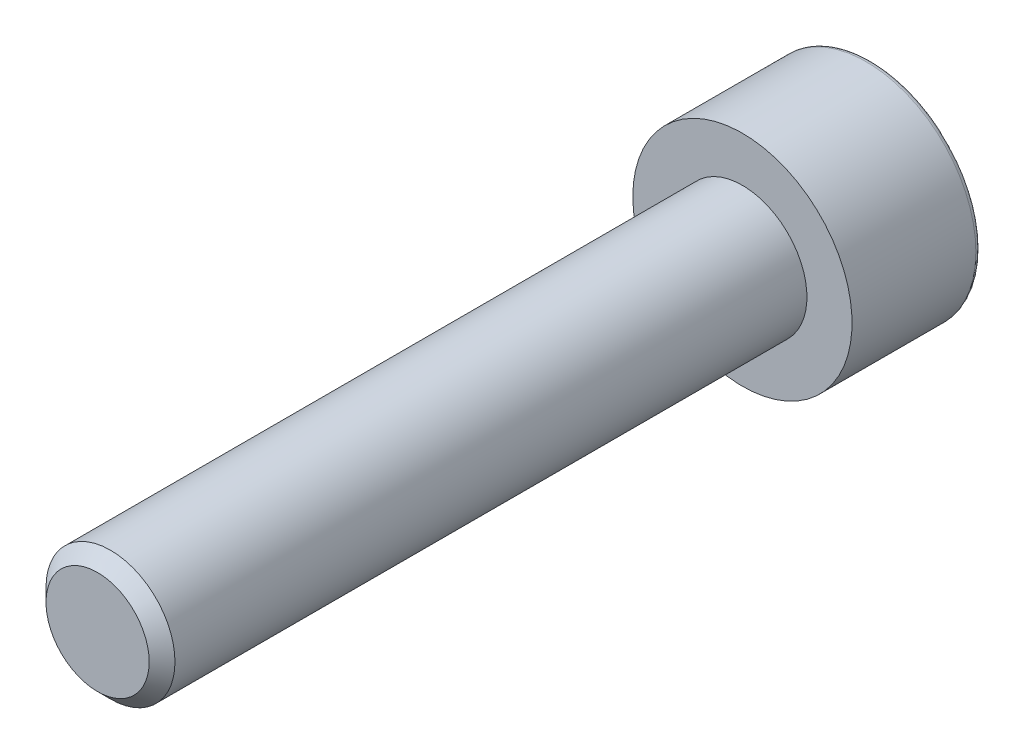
from build123d import *

# Parameters (mm, degrees)
ESQUISSE1_R          = 4.25
BASE_EXTRUSION_DEPTH = 2.975
ESQUISSE9_R          = 2.5
BOSS_EXTRU_1_DEPTH   = 25
CHANFREIN1_SIZE      = 0.5
CONG_1_R             = 0.2


with BuildPart() as part:
    # Esquisse1 → Base-Extrusion (new body)
    with BuildSketch(Plane.XY):
        with Locations(Location((0, 0, 0), (0, 0, 180))):
            Circle(ESQUISSE1_R)
        Polygon((1.154700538, -2), (2.309401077, 0), (1.154700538, 2), (-1.154700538, 2), (-2.309401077, 0), (-1.154700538, -2), align=None, mode=Mode.SUBTRACT)
    extrude(amount=BASE_EXTRUSION_DEPTH)

    # Esquisse8 → Boss.-R_vol.2 (revolve)
    with BuildSketch(Plane(origin=(0, 0, 0), x_dir=(0, 0, -1), z_dir=(1, 0, 0)), mode=Mode.PRIVATE) as boss_r_vol_2_sk:
        Polygon((-2.975, -4.25), (-5, -4.25), (-5, 0), (-4.129700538, 0), (-2.975, -2), align=None)
    revolve(boss_r_vol_2_sk.sketch.rotate(Axis((0, 0, 5.834969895), (0, 0, -1)), 90), axis=Axis((0, 0, 5.834969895), (0, 0, -1)))

    # Esquisse9 → Boss.-Extru.1 (add)
    with BuildSketch(Plane.XY.offset(5)):
        with Locations(Location((0, 0, 0), (0, 0, 180))):
            Circle(ESQUISSE9_R)
    extrude(amount=BOSS_EXTRU_1_DEPTH)

    # Chanfrein1
    chanfrein1_edges = [part.edges().sort_by_distance(p)[0] for p in [
        (2.5, 0, 30),
    ]]
    chamfer(chanfrein1_edges, length=CHANFREIN1_SIZE)

    # Cong_1
    cong_1_edges = [part.edges().sort_by_distance(p)[0] for p in [
        (4.25, 0, 0),
    ]]
    fillet(cong_1_edges, radius=CONG_1_R)

    # Esquisse10 → Enl_vement de mati_re-R_volution1 (revolve, cut)
    with BuildSketch(Plane(origin=(0, 0, 0), x_dir=(1, 0, 0), z_dir=(0, 1, 0))):
        Polygon((2.309401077, 0), (0, -1.333333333), (0, 0), align=None)
    revolve(axis=Axis((0, 0, -1.670116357), (0, 0, 1)), mode=Mode.SUBTRACT)


solid = part.part
